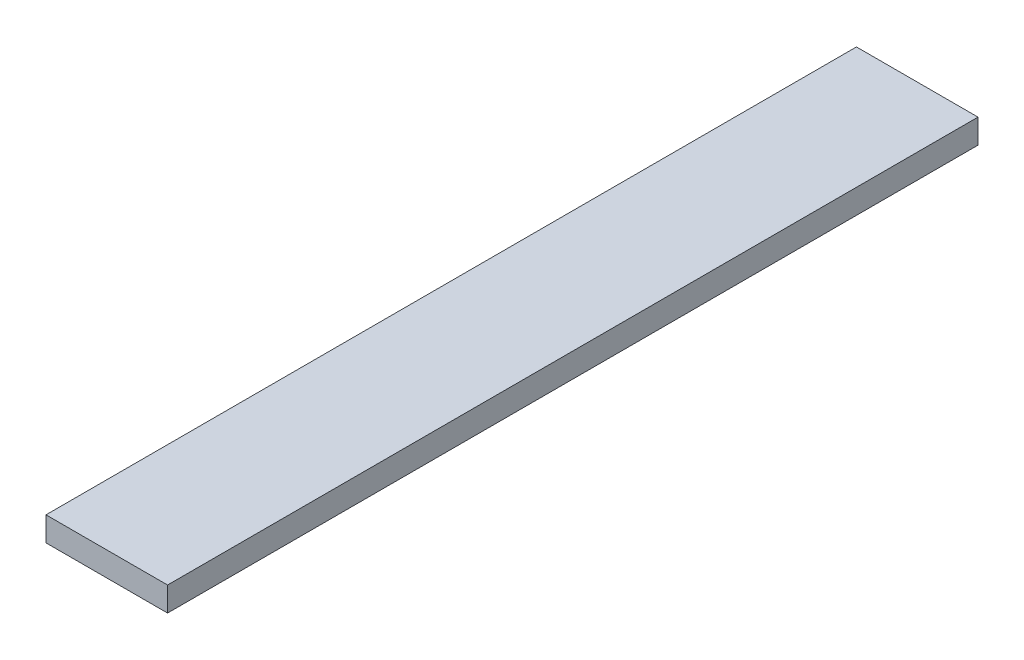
from build123d import *

# Parameters (mm, degrees)
SKETCH1_W           = 60
SKETCH1_H           = 400
BOSS_EXTRUDE1_DEPTH = 12


with BuildPart() as part:
    # Sketch1 → Boss-Extrude1 (new body)
    with BuildSketch(Plane(origin=(0, 0, 0), x_dir=(1, 0, 0), z_dir=(0, 1, 0))):
        Rectangle(SKETCH1_W, SKETCH1_H)
    extrude(amount=BOSS_EXTRUDE1_DEPTH)


solid = part.part
